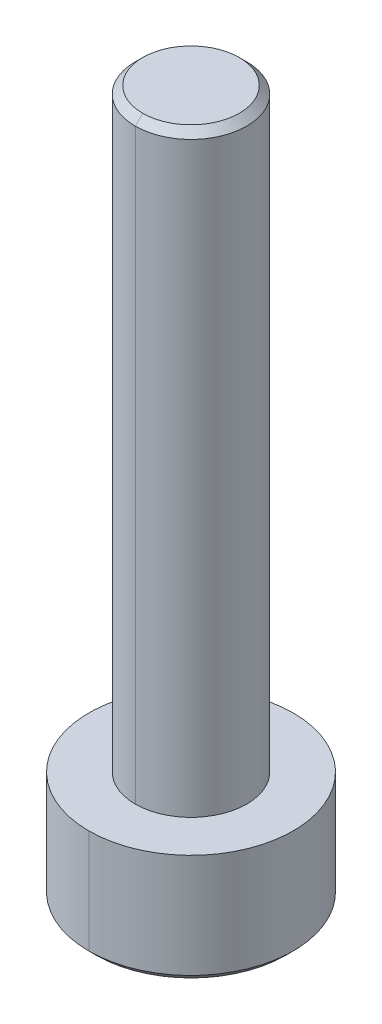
ISO-10303-21;
HEADER;
FILE_DESCRIPTION(('STEP AP214'),'2;1');
FILE_NAME('part.step','',(''),(''),'','','');
FILE_SCHEMA(('AUTOMOTIVE_DESIGN { 1 0 10303 214 1 1 1 1 }'));
ENDSEC;
DATA;
#1=APPLICATION_CONTEXT('core data for automotive mechanical design processes');
#2=APPLICATION_PROTOCOL_DEFINITION('international standard','automotive_design',2000,#1);
#3=PRODUCT_CONTEXT('',#1,'mechanical');
#4=PRODUCT('Part','Part','',(#3));
#5=PRODUCT_RELATED_PRODUCT_CATEGORY('part','',(#4));
#6=PRODUCT_DEFINITION_FORMATION('','',#4);
#7=PRODUCT_DEFINITION_CONTEXT('part definition',#1,'design');
#8=PRODUCT_DEFINITION('design','',#6,#7);
#9=PRODUCT_DEFINITION_SHAPE('','',#8);
#10=(LENGTH_UNIT() NAMED_UNIT(*) SI_UNIT(.MILLI.,.METRE.));
#11=(NAMED_UNIT(*) PLANE_ANGLE_UNIT() SI_UNIT($,.RADIAN.));
#12=(NAMED_UNIT(*) SI_UNIT($,.STERADIAN.) SOLID_ANGLE_UNIT());
#13=UNCERTAINTY_MEASURE_WITH_UNIT(LENGTH_MEASURE(1.E-05),#10,'distance_accuracy_value','');
#14=(GEOMETRIC_REPRESENTATION_CONTEXT(3) GLOBAL_UNCERTAINTY_ASSIGNED_CONTEXT((#13)) GLOBAL_UNIT_ASSIGNED_CONTEXT((#10,
#11,#12)) REPRESENTATION_CONTEXT('',''));
#15=CARTESIAN_POINT('',(0.,0.,0.));
#16=DIRECTION('',(0.,0.,1.));
#17=DIRECTION('',(1.,0.,0.));
#18=AXIS2_PLACEMENT_3D('',#15,#16,#17);
#19=CARTESIAN_POINT('',(30.426663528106,-20.,-8.152799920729));
#20=DIRECTION('',(0.,-1.,0.));
#21=DIRECTION('',(-1.,0.,0.));
#22=AXIS2_PLACEMENT_3D('',#19,#20,#21);
#23=PLANE('',#22);
#24=DIRECTION('',(-0.50000000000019,0.,-0.866025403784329));
#25=VECTOR('',#24,1.);
#26=CARTESIAN_POINT('',(31.148351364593,-20.,-9.402799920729));
#27=LINE('',#26,#25);
#28=CARTESIAN_POINT('',(31.87003920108,-20.,-8.152799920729));
#29=VERTEX_POINT('',#28);
#30=CARTESIAN_POINT('',(31.148351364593,-20.,-9.402799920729));
#31=VERTEX_POINT('',#30);
#32=EDGE_CURVE('E218',#29,#31,#27,.T.);
#33=ORIENTED_EDGE('',*,*,#32,.F.);
#34=DIRECTION('',(0.50000000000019,0.,-0.866025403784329));
#35=VECTOR('',#34,1.);
#36=CARTESIAN_POINT('',(31.87003920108,-20.,-8.152799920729));
#37=LINE('',#36,#35);
#38=CARTESIAN_POINT('',(31.148351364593,-20.,-6.902799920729));
#39=VERTEX_POINT('',#38);
#40=EDGE_CURVE('E10',#39,#29,#37,.T.);
#41=ORIENTED_EDGE('',*,*,#40,.F.);
#42=DIRECTION('',(1.,0.,0.));
#43=VECTOR('',#42,1.);
#44=CARTESIAN_POINT('',(31.148351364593,-20.,-6.902799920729));
#45=LINE('',#44,#43);
#46=CARTESIAN_POINT('',(29.704975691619,-20.,-6.902799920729));
#47=VERTEX_POINT('',#46);
#48=EDGE_CURVE('E222',#47,#39,#45,.T.);
#49=ORIENTED_EDGE('',*,*,#48,.F.);
#50=DIRECTION('',(0.50000000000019,0.,0.866025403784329));
#51=VECTOR('',#50,1.);
#52=CARTESIAN_POINT('',(29.704975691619,-20.,-6.902799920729));
#53=LINE('',#52,#51);
#54=CARTESIAN_POINT('',(28.983287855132,-20.,-8.152799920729));
#55=VERTEX_POINT('',#54);
#56=EDGE_CURVE('E237',#55,#47,#53,.T.);
#57=ORIENTED_EDGE('',*,*,#56,.F.);
#58=DIRECTION('',(-0.50000000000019,0.,0.866025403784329));
#59=VECTOR('',#58,1.);
#60=CARTESIAN_POINT('',(28.983287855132,-20.,-8.152799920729));
#61=LINE('',#60,#59);
#62=CARTESIAN_POINT('',(29.704975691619,-20.,-9.402799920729));
#63=VERTEX_POINT('',#62);
#64=EDGE_CURVE('E119',#63,#55,#61,.T.);
#65=ORIENTED_EDGE('',*,*,#64,.F.);
#66=DIRECTION('',(-1.,0.,0.));
#67=VECTOR('',#66,1.);
#68=CARTESIAN_POINT('',(29.704975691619,-20.,-9.402799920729));
#69=LINE('',#68,#67);
#70=EDGE_CURVE('E113',#31,#63,#69,.T.);
#71=ORIENTED_EDGE('',*,*,#70,.F.);
#72=EDGE_LOOP('',(#33,#41,#49,#57,#65,#71));
#73=FACE_BOUND('',#72,.T.);
#74=ADVANCED_FACE('F15',(#73),#23,.T.);
#75=CARTESIAN_POINT('',(31.87003920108,-20.,-8.152799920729));
#76=DIRECTION('',(-0.866025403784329,0.,-0.50000000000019));
#77=DIRECTION('',(-0.50000000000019,0.,0.866025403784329));
#78=AXIS2_PLACEMENT_3D('',#75,#76,#77);
#79=PLANE('',#78);
#80=DIRECTION('',(0.50000000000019,0.,-0.866025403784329));
#81=VECTOR('',#80,1.);
#82=CARTESIAN_POINT('',(31.87003920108,-21.5,-8.152799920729));
#83=LINE('',#82,#81);
#84=CARTESIAN_POINT('',(31.148351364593,-21.5,-6.902799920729));
#85=VERTEX_POINT('',#84);
#86=CARTESIAN_POINT('',(31.87003920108,-21.5,-8.152799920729));
#87=VERTEX_POINT('',#86);
#88=EDGE_CURVE('E224',#85,#87,#83,.T.);
#89=ORIENTED_EDGE('',*,*,#88,.F.);
#90=DIRECTION('',(0.,-1.,0.));
#91=VECTOR('',#90,1.);
#92=CARTESIAN_POINT('',(31.148351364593,-20.,-6.902799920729));
#93=LINE('',#92,#91);
#94=EDGE_CURVE('E26',#39,#85,#93,.T.);
#95=ORIENTED_EDGE('',*,*,#94,.F.);
#96=ORIENTED_EDGE('',*,*,#40,.T.);
#97=DIRECTION('',(0.,-1.,0.));
#98=VECTOR('',#97,1.);
#99=CARTESIAN_POINT('',(31.87003920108,-20.,-8.152799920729));
#100=LINE('',#99,#98);
#101=EDGE_CURVE('E69',#29,#87,#100,.T.);
#102=ORIENTED_EDGE('',*,*,#101,.T.);
#103=EDGE_LOOP('',(#89,#95,#96,#102));
#104=FACE_BOUND('',#103,.T.);
#105=ADVANCED_FACE('F340',(#104),#79,.T.);
#106=CARTESIAN_POINT('',(31.148351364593,-20.,-6.902799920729));
#107=DIRECTION('',(0.,0.,-1.));
#108=DIRECTION('',(-1.,0.,0.));
#109=AXIS2_PLACEMENT_3D('',#106,#107,#108);
#110=PLANE('',#109);
#111=DIRECTION('',(1.,0.,0.));
#112=VECTOR('',#111,1.);
#113=CARTESIAN_POINT('',(31.148351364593,-21.5,-6.902799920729));
#114=LINE('',#113,#112);
#115=CARTESIAN_POINT('',(29.704975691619,-21.5,-6.902799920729));
#116=VERTEX_POINT('',#115);
#117=EDGE_CURVE('E197',#116,#85,#114,.T.);
#118=ORIENTED_EDGE('',*,*,#117,.F.);
#119=DIRECTION('',(0.,-1.,0.));
#120=VECTOR('',#119,1.);
#121=CARTESIAN_POINT('',(29.704975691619,-20.,-6.902799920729));
#122=LINE('',#121,#120);
#123=EDGE_CURVE('E234',#47,#116,#122,.T.);
#124=ORIENTED_EDGE('',*,*,#123,.F.);
#125=ORIENTED_EDGE('',*,*,#48,.T.);
#126=ORIENTED_EDGE('',*,*,#94,.T.);
#127=EDGE_LOOP('',(#118,#124,#125,#126));
#128=FACE_BOUND('',#127,.T.);
#129=ADVANCED_FACE('F345',(#128),#110,.T.);
#130=CARTESIAN_POINT('',(29.704975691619,-20.,-6.902799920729));
#131=DIRECTION('',(0.866025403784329,0.,-0.50000000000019));
#132=DIRECTION('',(0.,-1.,0.));
#133=AXIS2_PLACEMENT_3D('',#130,#131,#132);
#134=PLANE('',#133);
#135=DIRECTION('',(0.50000000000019,0.,0.866025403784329));
#136=VECTOR('',#135,1.);
#137=CARTESIAN_POINT('',(29.704975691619,-21.5,-6.902799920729));
#138=LINE('',#137,#136);
#139=CARTESIAN_POINT('',(28.983287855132,-21.5,-8.152799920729));
#140=VERTEX_POINT('',#139);
#141=EDGE_CURVE('E209',#140,#116,#138,.T.);
#142=ORIENTED_EDGE('',*,*,#141,.F.);
#143=DIRECTION('',(0.,-1.,0.));
#144=VECTOR('',#143,1.);
#145=CARTESIAN_POINT('',(28.983287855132,-20.,-8.152799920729));
#146=LINE('',#145,#144);
#147=EDGE_CURVE('E268',#55,#140,#146,.T.);
#148=ORIENTED_EDGE('',*,*,#147,.F.);
#149=ORIENTED_EDGE('',*,*,#56,.T.);
#150=ORIENTED_EDGE('',*,*,#123,.T.);
#151=EDGE_LOOP('',(#142,#148,#149,#150));
#152=FACE_BOUND('',#151,.T.);
#153=ADVANCED_FACE('F397',(#152),#134,.T.);
#154=CARTESIAN_POINT('',(28.983287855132,-20.,-8.152799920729));
#155=DIRECTION('',(0.866025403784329,0.,0.50000000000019));
#156=DIRECTION('',(0.,-1.,0.));
#157=AXIS2_PLACEMENT_3D('',#154,#155,#156);
#158=PLANE('',#157);
#159=DIRECTION('',(-0.50000000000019,0.,0.866025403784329));
#160=VECTOR('',#159,1.);
#161=CARTESIAN_POINT('',(28.983287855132,-21.5,-8.152799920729));
#162=LINE('',#161,#160);
#163=CARTESIAN_POINT('',(29.704975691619,-21.5,-9.402799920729));
#164=VERTEX_POINT('',#163);
#165=EDGE_CURVE('E205',#164,#140,#162,.T.);
#166=ORIENTED_EDGE('',*,*,#165,.F.);
#167=DIRECTION('',(0.,-1.,0.));
#168=VECTOR('',#167,1.);
#169=CARTESIAN_POINT('',(29.704975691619,-20.,-9.402799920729));
#170=LINE('',#169,#168);
#171=EDGE_CURVE('E212',#63,#164,#170,.T.);
#172=ORIENTED_EDGE('',*,*,#171,.F.);
#173=ORIENTED_EDGE('',*,*,#64,.T.);
#174=ORIENTED_EDGE('',*,*,#147,.T.);
#175=EDGE_LOOP('',(#166,#172,#173,#174));
#176=FACE_BOUND('',#175,.T.);
#177=ADVANCED_FACE('F332',(#176),#158,.T.);
#178=CARTESIAN_POINT('',(29.704975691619,-20.,-9.402799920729));
#179=DIRECTION('',(0.,0.,1.));
#180=DIRECTION('',(1.,0.,0.));
#181=AXIS2_PLACEMENT_3D('',#178,#179,#180);
#182=PLANE('',#181);
#183=DIRECTION('',(-1.,0.,0.));
#184=VECTOR('',#183,1.);
#185=CARTESIAN_POINT('',(29.704975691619,-21.5,-9.402799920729));
#186=LINE('',#185,#184);
#187=CARTESIAN_POINT('',(31.148351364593,-21.5,-9.402799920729));
#188=VERTEX_POINT('',#187);
#189=EDGE_CURVE('E210',#188,#164,#186,.T.);
#190=ORIENTED_EDGE('',*,*,#189,.F.);
#191=DIRECTION('',(0.,-1.,0.));
#192=VECTOR('',#191,1.);
#193=CARTESIAN_POINT('',(31.148351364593,-20.,-9.402799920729));
#194=LINE('',#193,#192);
#195=EDGE_CURVE('E53',#31,#188,#194,.T.);
#196=ORIENTED_EDGE('',*,*,#195,.F.);
#197=ORIENTED_EDGE('',*,*,#70,.T.);
#198=ORIENTED_EDGE('',*,*,#171,.T.);
#199=EDGE_LOOP('',(#190,#196,#197,#198));
#200=FACE_BOUND('',#199,.T.);
#201=ADVANCED_FACE('F327',(#200),#182,.T.);
#202=CARTESIAN_POINT('',(31.148351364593,-20.,-9.402799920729));
#203=DIRECTION('',(-0.866025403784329,0.,0.50000000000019));
#204=DIRECTION('',(0.,1.,0.));
#205=AXIS2_PLACEMENT_3D('',#202,#203,#204);
#206=PLANE('',#205);
#207=DIRECTION('',(-0.50000000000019,0.,-0.866025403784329));
#208=VECTOR('',#207,1.);
#209=CARTESIAN_POINT('',(31.148351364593,-21.5,-9.402799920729));
#210=LINE('',#209,#208);
#211=EDGE_CURVE('E228',#87,#188,#210,.T.);
#212=ORIENTED_EDGE('',*,*,#211,.F.);
#213=ORIENTED_EDGE('',*,*,#101,.F.);
#214=ORIENTED_EDGE('',*,*,#32,.T.);
#215=ORIENTED_EDGE('',*,*,#195,.T.);
#216=EDGE_LOOP('',(#212,#213,#214,#215));
#217=FACE_BOUND('',#216,.T.);
#218=ADVANCED_FACE('F17',(#217),#206,.T.);
#219=CARTESIAN_POINT('',(31.726663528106,-2.5,-8.152799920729));
#220=DIRECTION('',(0.,1.,0.));
#221=DIRECTION('',(0.,0.,-1.));
#222=AXIS2_PLACEMENT_3D('',#219,#220,#221);
#223=PLANE('',#222);
#224=CARTESIAN_POINT('',(30.426663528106,-2.5,-8.152799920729));
#225=DIRECTION('',(0.,-1.,0.));
#226=DIRECTION('',(0.,0.,-1.));
#227=AXIS2_PLACEMENT_3D('',#224,#225,#226);
#228=CIRCLE('',#227,1.3);
#229=CARTESIAN_POINT('',(30.426663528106,-2.5,-9.452799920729));
#230=VERTEX_POINT('',#229);
#231=CARTESIAN_POINT('',(30.426663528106,-2.5,-6.852799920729));
#232=VERTEX_POINT('',#231);
#233=EDGE_CURVE('E179',#230,#232,#228,.T.);
#234=ORIENTED_EDGE('',*,*,#233,.F.);
#235=CARTESIAN_POINT('',(30.426663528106,-2.5,-8.152799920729));
#236=DIRECTION('',(0.,-1.,0.));
#237=DIRECTION('',(0.,0.,-1.));
#238=AXIS2_PLACEMENT_3D('',#235,#236,#237);
#239=CIRCLE('',#238,1.3);
#240=EDGE_CURVE('E158',#232,#230,#239,.T.);
#241=ORIENTED_EDGE('',*,*,#240,.F.);
#242=EDGE_LOOP('',(#234,#241));
#243=FACE_BOUND('',#242,.T.);
#244=ADVANCED_FACE('F388',(#243),#223,.T.);
#245=CARTESIAN_POINT('',(30.426663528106,-2.7,-8.152799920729));
#246=DIRECTION('',(0.,-1.,0.));
#247=DIRECTION('',(0.,0.,-1.));
#248=AXIS2_PLACEMENT_3D('',#245,#246,#247);
#249=CONICAL_SURFACE('',#248,1.5,0.785398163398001);
#250=DIRECTION('',(0.,-0.707106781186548,0.707106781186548));
#251=VECTOR('',#250,1.);
#252=CARTESIAN_POINT('',(30.426663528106,-2.7,-6.652799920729));
#253=LINE('',#252,#251);
#254=CARTESIAN_POINT('',(30.426663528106,-2.7,-6.652799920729));
#255=VERTEX_POINT('',#254);
#256=EDGE_CURVE('E149',#232,#255,#253,.T.);
#257=ORIENTED_EDGE('',*,*,#256,.F.);
#258=ORIENTED_EDGE('',*,*,#240,.T.);
#259=DIRECTION('',(0.,-0.707106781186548,-0.707106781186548));
#260=VECTOR('',#259,1.);
#261=CARTESIAN_POINT('',(30.426663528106,-2.7,-9.652799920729));
#262=LINE('',#261,#260);
#263=CARTESIAN_POINT('',(30.426663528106,-2.7,-9.652799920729));
#264=VERTEX_POINT('',#263);
#265=EDGE_CURVE('E152',#230,#264,#262,.T.);
#266=ORIENTED_EDGE('',*,*,#265,.T.);
#267=CARTESIAN_POINT('',(30.426663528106,-2.7,-8.152799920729));
#268=DIRECTION('',(0.,-1.,0.));
#269=DIRECTION('',(0.,0.,-1.));
#270=AXIS2_PLACEMENT_3D('',#267,#268,#269);
#271=CIRCLE('',#270,1.5);
#272=EDGE_CURVE('E145',#255,#264,#271,.T.);
#273=ORIENTED_EDGE('',*,*,#272,.F.);
#274=EDGE_LOOP('',(#257,#258,#266,#273));
#275=FACE_BOUND('',#274,.T.);
#276=ADVANCED_FACE('F147',(#275),#249,.T.);
#277=CARTESIAN_POINT('',(30.426663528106,-518.5,-8.152799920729));
#278=DIRECTION('',(0.,-1.,0.));
#279=DIRECTION('',(0.,0.,-1.));
#280=AXIS2_PLACEMENT_3D('',#277,#278,#279);
#281=CYLINDRICAL_SURFACE('',#280,1.5);
#282=DIRECTION('',(0.,-1.,0.));
#283=VECTOR('',#282,1.);
#284=CARTESIAN_POINT('',(30.426663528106,-518.5,-6.652799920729));
#285=LINE('',#284,#283);
#286=CARTESIAN_POINT('',(30.426663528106,-18.5,-6.652799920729));
#287=VERTEX_POINT('',#286);
#288=EDGE_CURVE('E162',#255,#287,#285,.T.);
#289=ORIENTED_EDGE('',*,*,#288,.F.);
#290=ORIENTED_EDGE('',*,*,#272,.T.);
#291=DIRECTION('',(0.,-1.,0.));
#292=VECTOR('',#291,1.);
#293=CARTESIAN_POINT('',(30.426663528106,-518.5,-9.652799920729));
#294=LINE('',#293,#292);
#295=CARTESIAN_POINT('',(30.426663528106,-18.5,-9.652799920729));
#296=VERTEX_POINT('',#295);
#297=EDGE_CURVE('E173',#264,#296,#294,.T.);
#298=ORIENTED_EDGE('',*,*,#297,.T.);
#299=CARTESIAN_POINT('',(30.426663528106,-18.5,-8.152799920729));
#300=DIRECTION('',(0.,-1.,0.));
#301=DIRECTION('',(0.,0.,-1.));
#302=AXIS2_PLACEMENT_3D('',#299,#300,#301);
#303=CIRCLE('',#302,1.5);
#304=EDGE_CURVE('E159',#287,#296,#303,.T.);
#305=ORIENTED_EDGE('',*,*,#304,.F.);
#306=EDGE_LOOP('',(#289,#290,#298,#305));
#307=FACE_BOUND('',#306,.T.);
#308=ADVANCED_FACE('F164',(#307),#281,.T.);
#309=CARTESIAN_POINT('',(33.176663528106,-18.5,-8.152799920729));
#310=DIRECTION('',(0.,1.,0.));
#311=DIRECTION('',(0.,0.,-1.));
#312=AXIS2_PLACEMENT_3D('',#309,#310,#311);
#313=PLANE('',#312);
#314=CARTESIAN_POINT('',(30.426663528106,-18.5,-8.152799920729));
#315=DIRECTION('',(0.,-1.,0.));
#316=DIRECTION('',(0.,0.,-1.));
#317=AXIS2_PLACEMENT_3D('',#314,#315,#316);
#318=CIRCLE('',#317,2.75);
#319=CARTESIAN_POINT('',(30.426663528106,-18.5,-10.90279992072));
#320=VERTEX_POINT('',#319);
#321=CARTESIAN_POINT('',(30.426663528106,-18.5,-5.402799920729));
#322=VERTEX_POINT('',#321);
#323=EDGE_CURVE('E240',#320,#322,#318,.T.);
#324=ORIENTED_EDGE('',*,*,#323,.F.);
#325=CARTESIAN_POINT('',(30.426663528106,-18.5,-8.152799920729));
#326=DIRECTION('',(0.,-1.,0.));
#327=DIRECTION('',(0.,0.,-1.));
#328=AXIS2_PLACEMENT_3D('',#325,#326,#327);
#329=CIRCLE('',#328,2.75);
#330=EDGE_CURVE('E196',#322,#320,#329,.T.);
#331=ORIENTED_EDGE('',*,*,#330,.F.);
#332=EDGE_LOOP('',(#324,#331));
#333=FACE_BOUND('',#332,.T.);
#334=CARTESIAN_POINT('',(30.426663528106,-18.5,-8.152799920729));
#335=DIRECTION('',(0.,-1.,0.));
#336=DIRECTION('',(0.,0.,-1.));
#337=AXIS2_PLACEMENT_3D('',#334,#335,#336);
#338=CIRCLE('',#337,1.5);
#339=EDGE_CURVE('E169',#296,#287,#338,.T.);
#340=ORIENTED_EDGE('',*,*,#339,.T.);
#341=ORIENTED_EDGE('',*,*,#304,.T.);
#342=EDGE_LOOP('',(#340,#341));
#343=FACE_BOUND('',#342,.T.);
#344=ADVANCED_FACE('F316',(#333,#343),#313,.T.);
#345=CARTESIAN_POINT('',(30.426663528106,-518.5,-8.152799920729));
#346=DIRECTION('',(0.,-1.,0.));
#347=DIRECTION('',(0.,0.,-1.));
#348=AXIS2_PLACEMENT_3D('',#345,#346,#347);
#349=CYLINDRICAL_SURFACE('',#348,2.75);
#350=DIRECTION('',(0.,-1.,0.));
#351=VECTOR('',#350,1.);
#352=CARTESIAN_POINT('',(30.426663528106,-518.5,-5.402799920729));
#353=LINE('',#352,#351);
#354=CARTESIAN_POINT('',(30.426663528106,-21.3,-5.402799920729));
#355=VERTEX_POINT('',#354);
#356=EDGE_CURVE('E244',#322,#355,#353,.T.);
#357=ORIENTED_EDGE('',*,*,#356,.F.);
#358=ORIENTED_EDGE('',*,*,#330,.T.);
#359=DIRECTION('',(0.,-1.,0.));
#360=VECTOR('',#359,1.);
#361=CARTESIAN_POINT('',(30.426663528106,-518.5,-10.90279992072));
#362=LINE('',#361,#360);
#363=CARTESIAN_POINT('',(30.426663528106,-21.3,-10.90279992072));
#364=VERTEX_POINT('',#363);
#365=EDGE_CURVE('E251',#320,#364,#362,.T.);
#366=ORIENTED_EDGE('',*,*,#365,.T.);
#367=CARTESIAN_POINT('',(30.426663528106,-21.3,-8.152799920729));
#368=DIRECTION('',(0.,-1.,0.));
#369=DIRECTION('',(0.,0.,-1.));
#370=AXIS2_PLACEMENT_3D('',#367,#368,#369);
#371=CIRCLE('',#370,2.75);
#372=EDGE_CURVE('E192',#355,#364,#371,.T.);
#373=ORIENTED_EDGE('',*,*,#372,.F.);
#374=EDGE_LOOP('',(#357,#358,#366,#373));
#375=FACE_BOUND('',#374,.T.);
#376=ADVANCED_FACE('F295',(#375),#349,.T.);
#377=CARTESIAN_POINT('',(30.426663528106,-21.5,-8.152799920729));
#378=DIRECTION('',(0.,1.,0.));
#379=DIRECTION('',(0.,0.,1.));
#380=AXIS2_PLACEMENT_3D('',#377,#378,#379);
#381=CONICAL_SURFACE('',#380,2.55,0.785398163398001);
#382=DIRECTION('',(0.,0.707106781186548,-0.707106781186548));
#383=VECTOR('',#382,1.);
#384=CARTESIAN_POINT('',(30.426663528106,-21.5,-10.70279992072));
#385=LINE('',#384,#383);
#386=CARTESIAN_POINT('',(30.426663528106,-21.5,-10.70279992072));
#387=VERTEX_POINT('',#386);
#388=EDGE_CURVE('E189',#387,#364,#385,.T.);
#389=ORIENTED_EDGE('',*,*,#388,.F.);
#390=CARTESIAN_POINT('',(30.426663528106,-21.5,-8.152799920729));
#391=DIRECTION('',(0.,-1.,0.));
#392=DIRECTION('',(0.,0.,-1.));
#393=AXIS2_PLACEMENT_3D('',#390,#391,#392);
#394=CIRCLE('',#393,2.55);
#395=CARTESIAN_POINT('',(30.426663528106,-21.5,-5.602799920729));
#396=VERTEX_POINT('',#395);
#397=EDGE_CURVE('E202',#396,#387,#394,.T.);
#398=ORIENTED_EDGE('',*,*,#397,.F.);
#399=DIRECTION('',(0.,0.707106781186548,0.707106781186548));
#400=VECTOR('',#399,1.);
#401=CARTESIAN_POINT('',(30.426663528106,-21.5,-5.602799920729));
#402=LINE('',#401,#400);
#403=EDGE_CURVE('E198',#396,#355,#402,.T.);
#404=ORIENTED_EDGE('',*,*,#403,.T.);
#405=ORIENTED_EDGE('',*,*,#372,.T.);
#406=EDGE_LOOP('',(#389,#398,#404,#405));
#407=FACE_BOUND('',#406,.T.);
#408=ADVANCED_FACE('F303',(#407),#381,.T.);
#409=CARTESIAN_POINT('',(30.426663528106,-21.5,-8.152799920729));
#410=DIRECTION('',(0.,-1.,0.));
#411=DIRECTION('',(-1.,0.,0.));
#412=AXIS2_PLACEMENT_3D('',#409,#410,#411);
#413=PLANE('',#412);
#414=ORIENTED_EDGE('',*,*,#88,.T.);
#415=ORIENTED_EDGE('',*,*,#211,.T.);
#416=ORIENTED_EDGE('',*,*,#189,.T.);
#417=ORIENTED_EDGE('',*,*,#165,.T.);
#418=ORIENTED_EDGE('',*,*,#141,.T.);
#419=ORIENTED_EDGE('',*,*,#117,.T.);
#420=EDGE_LOOP('',(#414,#415,#416,#417,#418,#419));
#421=FACE_BOUND('',#420,.T.);
#422=ORIENTED_EDGE('',*,*,#397,.T.);
#423=CARTESIAN_POINT('',(30.426663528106,-21.5,-8.152799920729));
#424=DIRECTION('',(0.,-1.,0.));
#425=DIRECTION('',(0.,0.,-1.));
#426=AXIS2_PLACEMENT_3D('',#423,#424,#425);
#427=CIRCLE('',#426,2.55);
#428=EDGE_CURVE('E255',#387,#396,#427,.T.);
#429=ORIENTED_EDGE('',*,*,#428,.T.);
#430=EDGE_LOOP('',(#422,#429));
#431=FACE_BOUND('',#430,.T.);
#432=ADVANCED_FACE('F308',(#421,#431),#413,.T.);
#433=CARTESIAN_POINT('',(30.426663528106,-21.5,-8.152799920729));
#434=DIRECTION('',(0.,1.,0.));
#435=DIRECTION('',(0.,0.,1.));
#436=AXIS2_PLACEMENT_3D('',#433,#434,#435);
#437=CONICAL_SURFACE('',#436,2.55,0.785398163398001);
#438=ORIENTED_EDGE('',*,*,#428,.F.);
#439=ORIENTED_EDGE('',*,*,#388,.T.);
#440=CARTESIAN_POINT('',(30.426663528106,-21.3,-8.152799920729));
#441=DIRECTION('',(0.,-1.,0.));
#442=DIRECTION('',(0.,0.,-1.));
#443=AXIS2_PLACEMENT_3D('',#440,#441,#442);
#444=CIRCLE('',#443,2.75);
#445=EDGE_CURVE('E19',#364,#355,#444,.T.);
#446=ORIENTED_EDGE('',*,*,#445,.T.);
#447=ORIENTED_EDGE('',*,*,#403,.F.);
#448=EDGE_LOOP('',(#438,#439,#446,#447));
#449=FACE_BOUND('',#448,.T.);
#450=ADVANCED_FACE('F288',(#449),#437,.T.);
#451=CARTESIAN_POINT('',(30.426663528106,-518.5,-8.152799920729));
#452=DIRECTION('',(0.,-1.,0.));
#453=DIRECTION('',(0.,0.,-1.));
#454=AXIS2_PLACEMENT_3D('',#451,#452,#453);
#455=CYLINDRICAL_SURFACE('',#454,2.75);
#456=ORIENTED_EDGE('',*,*,#323,.T.);
#457=ORIENTED_EDGE('',*,*,#356,.T.);
#458=ORIENTED_EDGE('',*,*,#445,.F.);
#459=ORIENTED_EDGE('',*,*,#365,.F.);
#460=EDGE_LOOP('',(#456,#457,#458,#459));
#461=FACE_BOUND('',#460,.T.);
#462=ADVANCED_FACE('F298',(#461),#455,.T.);
#463=CARTESIAN_POINT('',(30.426663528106,-518.5,-8.152799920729));
#464=DIRECTION('',(0.,-1.,0.));
#465=DIRECTION('',(0.,0.,-1.));
#466=AXIS2_PLACEMENT_3D('',#463,#464,#465);
#467=CYLINDRICAL_SURFACE('',#466,1.5);
#468=CARTESIAN_POINT('',(30.426663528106,-2.7,-8.152799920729));
#469=DIRECTION('',(0.,-1.,0.));
#470=DIRECTION('',(0.,0.,-1.));
#471=AXIS2_PLACEMENT_3D('',#468,#469,#470);
#472=CIRCLE('',#471,1.5);
#473=EDGE_CURVE('E171',#264,#255,#472,.T.);
#474=ORIENTED_EDGE('',*,*,#473,.T.);
#475=ORIENTED_EDGE('',*,*,#288,.T.);
#476=ORIENTED_EDGE('',*,*,#339,.F.);
#477=ORIENTED_EDGE('',*,*,#297,.F.);
#478=EDGE_LOOP('',(#474,#475,#476,#477));
#479=FACE_BOUND('',#478,.T.);
#480=ADVANCED_FACE('F172',(#479),#467,.T.);
#481=CARTESIAN_POINT('',(30.426663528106,-2.7,-8.152799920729));
#482=DIRECTION('',(0.,-1.,0.));
#483=DIRECTION('',(0.,0.,-1.));
#484=AXIS2_PLACEMENT_3D('',#481,#482,#483);
#485=CONICAL_SURFACE('',#484,1.5,0.785398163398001);
#486=ORIENTED_EDGE('',*,*,#233,.T.);
#487=ORIENTED_EDGE('',*,*,#256,.T.);
#488=ORIENTED_EDGE('',*,*,#473,.F.);
#489=ORIENTED_EDGE('',*,*,#265,.F.);
#490=EDGE_LOOP('',(#486,#487,#488,#489));
#491=FACE_BOUND('',#490,.T.);
#492=ADVANCED_FACE('F177',(#491),#485,.T.);
#493=CLOSED_SHELL('',(#74,#105,#129,#153,#177,#201,#218,#244,#276,#308,#344,#376,#408,#432,#450,
#462,#480,#492));
#494=MANIFOLD_SOLID_BREP('B1',#493);
#495=ADVANCED_BREP_SHAPE_REPRESENTATION('',(#18,#494),#14);
#496=SHAPE_DEFINITION_REPRESENTATION(#9,#495);
ENDSEC;
END-ISO-10303-21;
